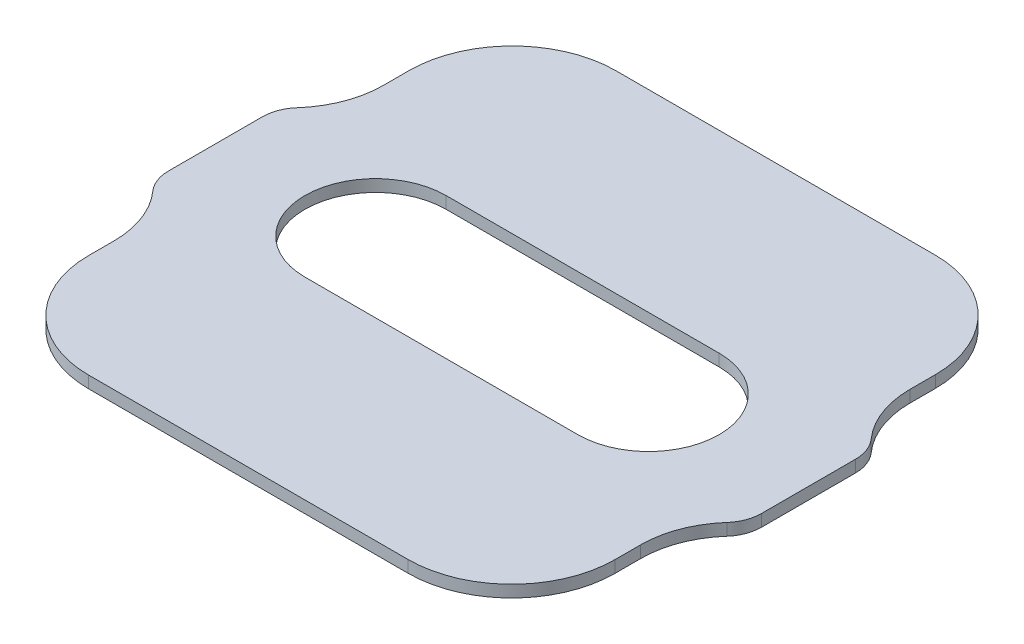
from build123d import *

# Parameters (mm, degrees)
BOSS_EXTRUDE3_DEPTH = 0.127
CUT_EXTRUDE2_DEPTH  = 24.721450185


with BuildPart() as part:
    # Sketch3 → Boss-Extrude3 (new body)
    with BuildSketch(Plane(origin=(0, 0, 0), x_dir=(1, 0, 0), z_dir=(0, 1, 0))):
        with BuildLine():
            Line((20.641488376, -3.030751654), (17.249062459, -3.030751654))
            ThreePointArc((17.249062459, -3.030751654), (16.471324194, -3.352855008), (16.149062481, -4.130527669))
            Line((16.149062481, -4.130527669), (16.149007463, -4.400727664))
            ThreePointArc((16.149007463, -4.400727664), (16.083672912, -4.756052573), (15.896341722, -5.064972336))
            ThreePointArc((15.896341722, -5.064972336), (15.821394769, -5.188578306), (15.795275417, -5.330751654))
            Line((15.795275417, -5.330751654), (15.795275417, -6.330751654))
            ThreePointArc((15.795275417, -6.330751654), (15.821394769, -6.472925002), (15.896341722, -6.596530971))
            ThreePointArc((15.896341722, -6.596530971), (16.083672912, -6.905450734), (16.149007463, -7.260775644))
            Line((16.149007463, -7.260775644), (16.149062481, -7.530975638))
            ThreePointArc((16.149062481, -7.530975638), (16.471324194, -8.308648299), (17.249062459, -8.630751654))
            Line((17.249062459, -8.630751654), (20.641488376, -8.630751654))
            ThreePointArc((20.641488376, -8.630751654), (21.419226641, -8.308648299), (21.741488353, -7.530975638))
            Line((21.741488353, -7.530975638), (21.741543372, -7.260775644))
            ThreePointArc((21.741543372, -7.260775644), (21.806877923, -6.905450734), (21.994209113, -6.596530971))
            ThreePointArc((21.994209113, -6.596530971), (22.069156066, -6.472925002), (22.095275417, -6.330751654))
            Line((22.095275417, -6.330751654), (22.095275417, -5.330751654))
            ThreePointArc((22.095275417, -5.330751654), (22.069156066, -5.188578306), (21.994209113, -5.064972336))
            ThreePointArc((21.994209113, -5.064972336), (21.806877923, -4.756052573), (21.741543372, -4.400727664))
            Line((21.741543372, -4.400727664), (21.741488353, -4.130527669))
            ThreePointArc((21.741488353, -4.130527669), (21.419226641, -3.352855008), (20.641488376, -3.030751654))
        make_face()
    extrude(amount=BOSS_EXTRUDE3_DEPTH)

    # Sketch4 → Cut-Extrude2 (cut, through all)
    with BuildSketch(Plane(origin=(0, 0.127, 0), x_dir=(1, 0, 0), z_dir=(0, 1, 0))):
        with BuildLine():
            Line((17.495275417, -5.080751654), (20.395275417, -5.080751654))
            ThreePointArc((20.395275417, -5.080751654), (21.145275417, -5.830751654), (20.395275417, -6.580751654))
            Line((20.395275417, -6.580751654), (17.495275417, -6.580751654))
            ThreePointArc((17.495275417, -6.580751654), (16.745275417, -5.830751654), (17.495275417, -5.080751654))
        make_face()
    extrude(amount=-CUT_EXTRUDE2_DEPTH, mode=Mode.SUBTRACT)


solid = part.part
